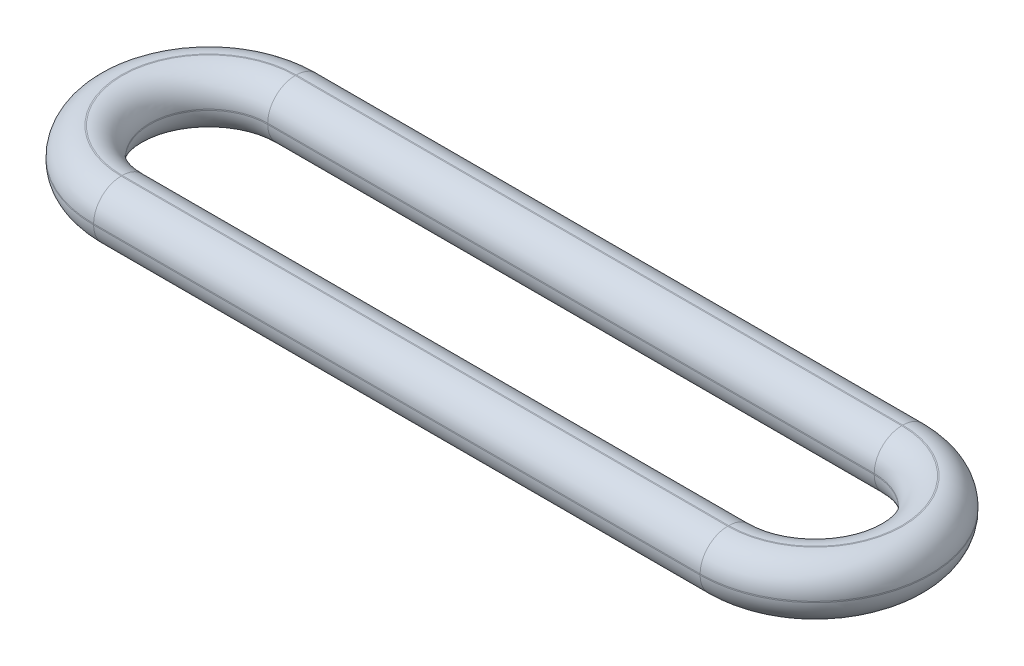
from build123d import *

# Parameters (mm, degrees)
BOSS_EXTRUDE1_DEPTH = 1
FILLET1_R           = 0.49


with BuildPart() as part:
    # Sketch1 → Boss-Extrude1 (new body)
    with BuildSketch(Plane(origin=(0, 0, 0), x_dir=(1, 0, 0), z_dir=(0, 1, 0))):
        with BuildLine():
            Line((0, 2.05), (10.8, 2.05))
            ThreePointArc((10.8, 2.05), (12.85, 0), (10.8, -2.05))
            Line((10.8, -2.05), (0, -2.05))
            ThreePointArc((0, -2.05), (-2.05, 0), (0, 2.05))
        make_face()
        with BuildLine():
            Line((0, 1.05), (10.8, 1.05))
            ThreePointArc((10.8, 1.05), (11.85, 0), (10.8, -1.05))
            Line((10.8, -1.05), (0, -1.05))
            ThreePointArc((0, -1.05), (-1.05, 0), (0, 1.05))
        make_face(mode=Mode.SUBTRACT)
    extrude(amount=BOSS_EXTRUDE1_DEPTH)

    # Fillet1
    fillet1_edges = [part.edges().sort_by_distance(p)[0] for p in [
        (12.85, 1, 0),
        (5.4, 1, -2.05),
        (-1.05, 0, 0),
        (5.4, 0, 1.05),
        (11.85, 0, 0),
        (5.4, 0, -1.05),
        (-1.05, 1, 0),
        (5.4, 1, 1.05),
        (11.85, 1, 0),
        (5.4, 1, -1.05),
        (-2.05, 1, 0),
        (5.4, 0, -2.05),
        (12.85, 0, 0),
        (5.4, 0, 2.05),
        (-2.05, 0, 0),
        (5.4, 1, 2.05),
    ]]
    fillet(fillet1_edges, radius=FILLET1_R)


solid = part.part
